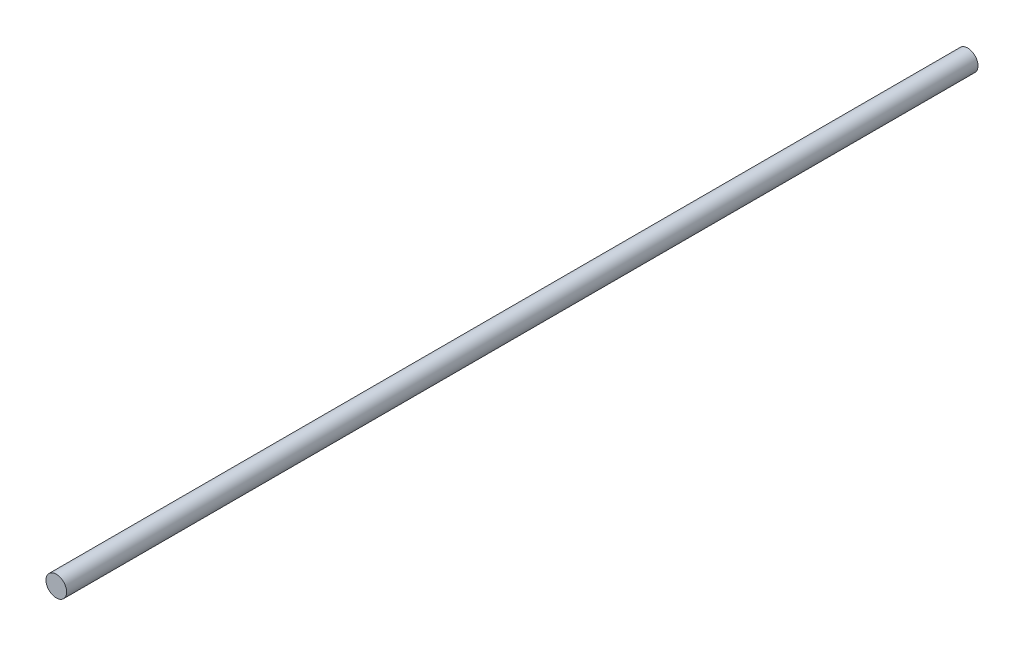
ISO-10303-21;
HEADER;
FILE_DESCRIPTION(('STEP AP214'),'2;1');
FILE_NAME('part.step','',(''),(''),'','','');
FILE_SCHEMA(('AUTOMOTIVE_DESIGN { 1 0 10303 214 1 1 1 1 }'));
ENDSEC;
DATA;
#1=APPLICATION_CONTEXT('core data for automotive mechanical design processes');
#2=APPLICATION_PROTOCOL_DEFINITION('international standard','automotive_design',2000,#1);
#3=PRODUCT_CONTEXT('',#1,'mechanical');
#4=PRODUCT('Part','Part','',(#3));
#5=PRODUCT_RELATED_PRODUCT_CATEGORY('part','',(#4));
#6=PRODUCT_DEFINITION_FORMATION('','',#4);
#7=PRODUCT_DEFINITION_CONTEXT('part definition',#1,'design');
#8=PRODUCT_DEFINITION('design','',#6,#7);
#9=PRODUCT_DEFINITION_SHAPE('','',#8);
#10=(LENGTH_UNIT() NAMED_UNIT(*) SI_UNIT(.MILLI.,.METRE.));
#11=(NAMED_UNIT(*) PLANE_ANGLE_UNIT() SI_UNIT($,.RADIAN.));
#12=(NAMED_UNIT(*) SI_UNIT($,.STERADIAN.) SOLID_ANGLE_UNIT());
#13=UNCERTAINTY_MEASURE_WITH_UNIT(LENGTH_MEASURE(1.E-05),#10,'distance_accuracy_value','');
#14=(GEOMETRIC_REPRESENTATION_CONTEXT(3) GLOBAL_UNCERTAINTY_ASSIGNED_CONTEXT((#13)) GLOBAL_UNIT_ASSIGNED_CONTEXT((#10,
#11,#12)) REPRESENTATION_CONTEXT('',''));
#15=CARTESIAN_POINT('',(0.,0.,0.));
#16=DIRECTION('',(0.,0.,1.));
#17=DIRECTION('',(1.,0.,0.));
#18=AXIS2_PLACEMENT_3D('',#15,#16,#17);
#19=CARTESIAN_POINT('',(0.,0.,-2650.));
#20=DIRECTION('',(0.,0.,1.));
#21=DIRECTION('',(1.,0.,0.));
#22=AXIS2_PLACEMENT_3D('',#19,#20,#21);
#23=CYLINDRICAL_SURFACE('',#22,30.);
#24=CARTESIAN_POINT('',(0.,0.,-2650.));
#25=DIRECTION('',(0.,0.,1.));
#26=DIRECTION('',(1.,0.,0.));
#27=AXIS2_PLACEMENT_3D('',#24,#25,#26);
#28=CIRCLE('',#27,30.);
#29=CARTESIAN_POINT('',(30.,0.,-2650.));
#30=VERTEX_POINT('',#29);
#31=EDGE_CURVE('E10',#30,#30,#28,.T.);
#32=ORIENTED_EDGE('',*,*,#31,.T.);
#33=EDGE_LOOP('',(#32));
#34=FACE_BOUND('',#33,.T.);
#35=CARTESIAN_POINT('',(0.,0.,0.));
#36=DIRECTION('',(0.,0.,1.));
#37=DIRECTION('',(1.,0.,0.));
#38=AXIS2_PLACEMENT_3D('',#35,#36,#37);
#39=CIRCLE('',#38,30.);
#40=CARTESIAN_POINT('',(30.,0.,0.));
#41=VERTEX_POINT('',#40);
#42=EDGE_CURVE('E40',#41,#41,#39,.T.);
#43=ORIENTED_EDGE('',*,*,#42,.F.);
#44=EDGE_LOOP('',(#43));
#45=FACE_BOUND('',#44,.T.);
#46=ADVANCED_FACE('F37',(#34,#45),#23,.T.);
#47=CARTESIAN_POINT('',(0.,0.,-2650.));
#48=DIRECTION('',(0.,0.,1.));
#49=DIRECTION('',(1.,0.,0.));
#50=AXIS2_PLACEMENT_3D('',#47,#48,#49);
#51=PLANE('',#50);
#52=ORIENTED_EDGE('',*,*,#31,.F.);
#53=EDGE_LOOP('',(#52));
#54=FACE_BOUND('',#53,.T.);
#55=ADVANCED_FACE('F54',(#54),#51,.F.);
#56=CARTESIAN_POINT('',(0.,0.,0.));
#57=DIRECTION('',(0.,0.,1.));
#58=DIRECTION('',(1.,0.,0.));
#59=AXIS2_PLACEMENT_3D('',#56,#57,#58);
#60=PLANE('',#59);
#61=ORIENTED_EDGE('',*,*,#42,.T.);
#62=EDGE_LOOP('',(#61));
#63=FACE_BOUND('',#62,.T.);
#64=ADVANCED_FACE('F51',(#63),#60,.T.);
#65=CLOSED_SHELL('',(#46,#55,#64));
#66=MANIFOLD_SOLID_BREP('B2',#65);
#67=ADVANCED_BREP_SHAPE_REPRESENTATION('',(#18,#66),#14);
#68=SHAPE_DEFINITION_REPRESENTATION(#9,#67);
ENDSEC;
END-ISO-10303-21;
